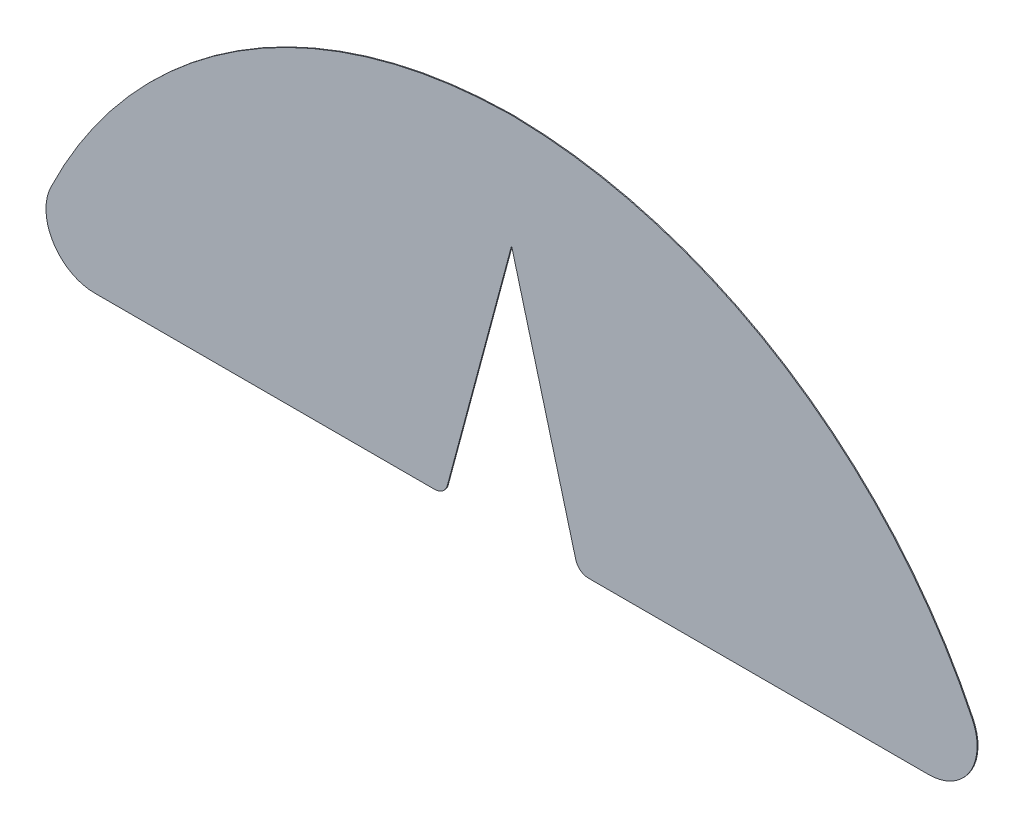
ISO-10303-21;
HEADER;
FILE_DESCRIPTION(('STEP AP214'),'2;1');
FILE_NAME('part.step','',(''),(''),'','','');
FILE_SCHEMA(('AUTOMOTIVE_DESIGN { 1 0 10303 214 1 1 1 1 }'));
ENDSEC;
DATA;
#1=APPLICATION_CONTEXT('core data for automotive mechanical design processes');
#2=APPLICATION_PROTOCOL_DEFINITION('international standard','automotive_design',2000,#1);
#3=PRODUCT_CONTEXT('',#1,'mechanical');
#4=PRODUCT('Part','Part','',(#3));
#5=PRODUCT_RELATED_PRODUCT_CATEGORY('part','',(#4));
#6=PRODUCT_DEFINITION_FORMATION('','',#4);
#7=PRODUCT_DEFINITION_CONTEXT('part definition',#1,'design');
#8=PRODUCT_DEFINITION('design','',#6,#7);
#9=PRODUCT_DEFINITION_SHAPE('','',#8);
#10=(LENGTH_UNIT() NAMED_UNIT(*) SI_UNIT(.MILLI.,.METRE.));
#11=(NAMED_UNIT(*) PLANE_ANGLE_UNIT() SI_UNIT($,.RADIAN.));
#12=(NAMED_UNIT(*) SI_UNIT($,.STERADIAN.) SOLID_ANGLE_UNIT());
#13=UNCERTAINTY_MEASURE_WITH_UNIT(LENGTH_MEASURE(1.E-05),#10,'distance_accuracy_value','');
#14=(GEOMETRIC_REPRESENTATION_CONTEXT(3) GLOBAL_UNCERTAINTY_ASSIGNED_CONTEXT((#13)) GLOBAL_UNIT_ASSIGNED_CONTEXT((#10,
#11,#12)) REPRESENTATION_CONTEXT('',''));
#15=CARTESIAN_POINT('',(0.,0.,0.));
#16=DIRECTION('',(0.,0.,1.));
#17=DIRECTION('',(1.,0.,0.));
#18=AXIS2_PLACEMENT_3D('',#15,#16,#17);
#19=CARTESIAN_POINT('',(0.955553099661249,-115.621051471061,0.2));
#20=DIRECTION('',(0.,0.,-1.));
#21=DIRECTION('',(-1.,0.,0.));
#22=AXIS2_PLACEMENT_3D('',#19,#20,#21);
#23=CYLINDRICAL_SURFACE('',#22,116.625);
#24=CARTESIAN_POINT('',(0.955553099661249,-115.621051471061,0.));
#25=DIRECTION('',(0.,0.,1.));
#26=DIRECTION('',(1.,0.,0.));
#27=AXIS2_PLACEMENT_3D('',#24,#25,#26);
#28=CIRCLE('',#27,116.625);
#29=CARTESIAN_POINT('',(1.,1.00394005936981,0.));
#30=VERTEX_POINT('',#29);
#31=CARTESIAN_POINT('',(0.,1.00003385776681,0.));
#32=VERTEX_POINT('',#31);
#33=EDGE_CURVE('E200',#30,#32,#28,.T.);
#34=ORIENTED_EDGE('',*,*,#33,.T.);
#35=DIRECTION('',(0.,0.,-1.));
#36=VECTOR('',#35,1.);
#37=CARTESIAN_POINT('',(0.,1.00003385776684,0.1));
#38=LINE('',#37,#36);
#39=CARTESIAN_POINT('',(0.,1.00003385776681,0.2));
#40=VERTEX_POINT('',#39);
#41=EDGE_CURVE('E155',#32,#40,#38,.F.);
#42=ORIENTED_EDGE('',*,*,#41,.T.);
#43=CARTESIAN_POINT('',(0.955553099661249,-115.621051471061,0.2));
#44=DIRECTION('',(0.,0.,1.));
#45=DIRECTION('',(1.,0.,0.));
#46=AXIS2_PLACEMENT_3D('',#43,#44,#45);
#47=CIRCLE('',#46,116.625);
#48=CARTESIAN_POINT('',(1.,1.00394005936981,0.2));
#49=VERTEX_POINT('',#48);
#50=EDGE_CURVE('E213',#49,#40,#47,.T.);
#51=ORIENTED_EDGE('',*,*,#50,.F.);
#52=DIRECTION('',(0.,0.,-1.));
#53=VECTOR('',#52,1.);
#54=CARTESIAN_POINT('',(1.,1.00394005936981,0.2));
#55=LINE('',#54,#53);
#56=EDGE_CURVE('E225',#49,#30,#55,.T.);
#57=ORIENTED_EDGE('',*,*,#56,.T.);
#58=EDGE_LOOP('',(#34,#42,#51,#57));
#59=FACE_BOUND('',#58,.T.);
#60=ADVANCED_FACE('F27',(#59),#23,.T.);
#61=CARTESIAN_POINT('',(-1.,0.987552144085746,0.2));
#62=VERTEX_POINT('',#61);
#63=CARTESIAN_POINT('',(-104.228100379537,-65.2445721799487,0.2));
#64=VERTEX_POINT('',#63);
#65=EDGE_CURVE('E212',#62,#64,#47,.T.);
#66=ORIENTED_EDGE('',*,*,#65,.F.);
#67=DIRECTION('',(0.,0.,-1.));
#68=VECTOR('',#67,1.);
#69=CARTESIAN_POINT('',(-1.,0.987552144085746,0.2));
#70=LINE('',#69,#68);
#71=CARTESIAN_POINT('',(-1.,0.987552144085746,0.));
#72=VERTEX_POINT('',#71);
#73=EDGE_CURVE('E195',#62,#72,#70,.T.);
#74=ORIENTED_EDGE('',*,*,#73,.T.);
#75=CARTESIAN_POINT('',(-104.228100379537,-65.2445721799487,0.));
#76=VERTEX_POINT('',#75);
#77=EDGE_CURVE('E137',#72,#76,#28,.T.);
#78=ORIENTED_EDGE('',*,*,#77,.T.);
#79=DIRECTION('',(0.,0.,-1.));
#80=VECTOR('',#79,1.);
#81=CARTESIAN_POINT('',(-104.228100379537,-65.2445721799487,0.2));
#82=LINE('',#81,#80);
#83=EDGE_CURVE('E11',#64,#76,#82,.T.);
#84=ORIENTED_EDGE('',*,*,#83,.F.);
#85=EDGE_LOOP('',(#66,#74,#78,#84));
#86=FACE_BOUND('',#85,.T.);
#87=ADVANCED_FACE('F29',(#86),#23,.T.);
#88=CARTESIAN_POINT('',(-94.3072413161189,-69.99605147,0.2));
#89=DIRECTION('',(0.,0.,-1.));
#90=DIRECTION('',(-1.,0.,0.));
#91=AXIS2_PLACEMENT_3D('',#88,#89,#90);
#92=CYLINDRICAL_SURFACE('',#91,11.);
#93=CARTESIAN_POINT('',(-94.3072413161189,-69.99605147,0.));
#94=DIRECTION('',(0.,0.,1.));
#95=DIRECTION('',(1.,0.,0.));
#96=AXIS2_PLACEMENT_3D('',#93,#94,#95);
#97=CIRCLE('',#96,11.);
#98=CARTESIAN_POINT('',(-94.3072413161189,-80.99605147,0.));
#99=VERTEX_POINT('',#98);
#100=EDGE_CURVE('E202',#76,#99,#97,.T.);
#101=ORIENTED_EDGE('',*,*,#100,.T.);
#102=DIRECTION('',(0.,0.,-1.));
#103=VECTOR('',#102,1.);
#104=CARTESIAN_POINT('',(-94.3072413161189,-80.99605147,0.2));
#105=LINE('',#104,#103);
#106=CARTESIAN_POINT('',(-94.3072413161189,-80.99605147,0.2));
#107=VERTEX_POINT('',#106);
#108=EDGE_CURVE('E35',#107,#99,#105,.T.);
#109=ORIENTED_EDGE('',*,*,#108,.F.);
#110=CARTESIAN_POINT('',(-94.3072413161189,-69.99605147,0.2));
#111=DIRECTION('',(0.,0.,1.));
#112=DIRECTION('',(1.,0.,0.));
#113=AXIS2_PLACEMENT_3D('',#110,#111,#112);
#114=CIRCLE('',#113,11.);
#115=EDGE_CURVE('E216',#64,#107,#114,.T.);
#116=ORIENTED_EDGE('',*,*,#115,.F.);
#117=ORIENTED_EDGE('',*,*,#83,.T.);
#118=EDGE_LOOP('',(#101,#109,#116,#117));
#119=FACE_BOUND('',#118,.T.);
#120=ADVANCED_FACE('F277',(#119),#92,.T.);
#121=CARTESIAN_POINT('',(-17.4158993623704,-80.99605147,0.2));
#122=DIRECTION('',(0.,1.,0.));
#123=DIRECTION('',(0.,0.,1.));
#124=AXIS2_PLACEMENT_3D('',#121,#122,#123);
#125=PLANE('',#124);
#126=DIRECTION('',(1.,0.,0.));
#127=VECTOR('',#126,1.);
#128=CARTESIAN_POINT('',(-17.4158993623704,-80.99605147,0.));
#129=LINE('',#128,#127);
#130=CARTESIAN_POINT('',(-17.4158993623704,-80.99605147,0.));
#131=VERTEX_POINT('',#130);
#132=EDGE_CURVE('E204',#99,#131,#129,.T.);
#133=ORIENTED_EDGE('',*,*,#132,.T.);
#134=DIRECTION('',(0.,0.,-1.));
#135=VECTOR('',#134,1.);
#136=CARTESIAN_POINT('',(-17.4158993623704,-80.99605147,0.2));
#137=LINE('',#136,#135);
#138=CARTESIAN_POINT('',(-17.4158993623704,-80.99605147,0.2));
#139=VERTEX_POINT('',#138);
#140=EDGE_CURVE('E231',#139,#131,#137,.T.);
#141=ORIENTED_EDGE('',*,*,#140,.F.);
#142=DIRECTION('',(1.,0.,0.));
#143=VECTOR('',#142,1.);
#144=CARTESIAN_POINT('',(-17.4158993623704,-80.99605147,0.2));
#145=LINE('',#144,#143);
#146=EDGE_CURVE('E218',#107,#139,#145,.T.);
#147=ORIENTED_EDGE('',*,*,#146,.F.);
#148=ORIENTED_EDGE('',*,*,#108,.T.);
#149=EDGE_LOOP('',(#133,#141,#147,#148));
#150=FACE_BOUND('',#149,.T.);
#151=ADVANCED_FACE('F238',(#150),#125,.F.);
#152=CARTESIAN_POINT('',(-17.4158993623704,-77.99605147,0.2));
#153=DIRECTION('',(0.,0.,-1.));
#154=DIRECTION('',(-1.,0.,0.));
#155=AXIS2_PLACEMENT_3D('',#152,#153,#154);
#156=CYLINDRICAL_SURFACE('',#155,3.);
#157=CARTESIAN_POINT('',(-17.4158993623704,-77.99605147,0.));
#158=DIRECTION('',(0.,0.,1.));
#159=DIRECTION('',(-1.,0.,0.));
#160=AXIS2_PLACEMENT_3D('',#157,#158,#159);
#161=CIRCLE('',#160,3.);
#162=CARTESIAN_POINT('',(-14.5181218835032,-78.7725086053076,0.));
#163=VERTEX_POINT('',#162);
#164=EDGE_CURVE('E206',#131,#163,#161,.T.);
#165=ORIENTED_EDGE('',*,*,#164,.T.);
#166=DIRECTION('',(0.,0.,-1.));
#167=VECTOR('',#166,1.);
#168=CARTESIAN_POINT('',(-14.5181218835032,-78.7725086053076,0.2));
#169=LINE('',#168,#167);
#170=CARTESIAN_POINT('',(-14.5181218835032,-78.7725086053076,0.2));
#171=VERTEX_POINT('',#170);
#172=EDGE_CURVE('E228',#171,#163,#169,.T.);
#173=ORIENTED_EDGE('',*,*,#172,.F.);
#174=CARTESIAN_POINT('',(-17.4158993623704,-77.99605147,0.2));
#175=DIRECTION('',(0.,0.,1.));
#176=DIRECTION('',(-1.,0.,0.));
#177=AXIS2_PLACEMENT_3D('',#174,#175,#176);
#178=CIRCLE('',#177,3.);
#179=EDGE_CURVE('E220',#139,#171,#178,.T.);
#180=ORIENTED_EDGE('',*,*,#179,.F.);
#181=ORIENTED_EDGE('',*,*,#140,.T.);
#182=EDGE_LOOP('',(#165,#173,#180,#181));
#183=FACE_BOUND('',#182,.T.);
#184=ADVANCED_FACE('F246',(#183),#156,.T.);
#185=CARTESIAN_POINT('',(1.,-20.8580892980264,0.2));
#186=DIRECTION('',(-0.965925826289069,0.258819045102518,0.));
#187=DIRECTION('',(-0.258819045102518,-0.965925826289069,0.));
#188=AXIS2_PLACEMENT_3D('',#185,#186,#187);
#189=PLANE('',#188);
#190=DIRECTION('',(0.258819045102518,0.965925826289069,0.));
#191=VECTOR('',#190,1.);
#192=CARTESIAN_POINT('',(1.,-20.8580892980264,0.));
#193=LINE('',#192,#191);
#194=CARTESIAN_POINT('',(0.,-24.5901401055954,0.));
#195=VERTEX_POINT('',#194);
#196=EDGE_CURVE('E208',#163,#195,#193,.T.);
#197=ORIENTED_EDGE('',*,*,#196,.T.);
#198=DIRECTION('',(0.,0.,1.));
#199=VECTOR('',#198,1.);
#200=CARTESIAN_POINT('',(0.,-24.5901401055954,0.2));
#201=LINE('',#200,#199);
#202=CARTESIAN_POINT('',(0.,-24.5901401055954,0.2));
#203=VERTEX_POINT('',#202);
#204=EDGE_CURVE('E50',#195,#203,#201,.T.);
#205=ORIENTED_EDGE('',*,*,#204,.T.);
#206=DIRECTION('',(0.258819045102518,0.965925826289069,0.));
#207=VECTOR('',#206,1.);
#208=CARTESIAN_POINT('',(1.,-20.8580892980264,0.2));
#209=LINE('',#208,#207);
#210=EDGE_CURVE('E222',#171,#203,#209,.T.);
#211=ORIENTED_EDGE('',*,*,#210,.F.);
#212=ORIENTED_EDGE('',*,*,#172,.T.);
#213=EDGE_LOOP('',(#197,#205,#211,#212));
#214=FACE_BOUND('',#213,.T.);
#215=ADVANCED_FACE('F248',(#214),#189,.F.);
#216=CARTESIAN_POINT('',(1.,1.00394005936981,0.2));
#217=DIRECTION('',(-1.,0.,0.));
#218=DIRECTION('',(0.,0.,1.));
#219=AXIS2_PLACEMENT_3D('',#216,#217,#218);
#220=PLANE('',#219);
#221=DIRECTION('',(0.,1.,0.));
#222=VECTOR('',#221,1.);
#223=CARTESIAN_POINT('',(1.,1.00394005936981,0.2));
#224=LINE('',#223,#222);
#225=CARTESIAN_POINT('',(1.,0.987552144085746,0.2));
#226=VERTEX_POINT('',#225);
#227=EDGE_CURVE('E42',#226,#49,#224,.T.);
#228=ORIENTED_EDGE('',*,*,#227,.F.);
#229=DIRECTION('',(0.,0.,-1.));
#230=VECTOR('',#229,1.);
#231=CARTESIAN_POINT('',(1.,0.987552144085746,0.2));
#232=LINE('',#231,#230);
#233=CARTESIAN_POINT('',(1.,0.987552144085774,0.));
#234=VERTEX_POINT('',#233);
#235=EDGE_CURVE('E197',#226,#234,#232,.T.);
#236=ORIENTED_EDGE('',*,*,#235,.T.);
#237=DIRECTION('',(0.,1.,0.));
#238=VECTOR('',#237,1.);
#239=CARTESIAN_POINT('',(1.,1.00394005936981,0.));
#240=LINE('',#239,#238);
#241=EDGE_CURVE('E210',#234,#30,#240,.T.);
#242=ORIENTED_EDGE('',*,*,#241,.T.);
#243=ORIENTED_EDGE('',*,*,#56,.F.);
#244=EDGE_LOOP('',(#228,#236,#242,#243));
#245=FACE_BOUND('',#244,.T.);
#246=ADVANCED_FACE('F272',(#245),#220,.F.);
#247=CARTESIAN_POINT('',(0.955553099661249,-115.621051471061,0.2));
#248=DIRECTION('',(0.,0.,1.));
#249=DIRECTION('',(1.,0.,0.));
#250=AXIS2_PLACEMENT_3D('',#247,#248,#249);
#251=PLANE('',#250);
#252=ORIENTED_EDGE('',*,*,#50,.T.);
#253=CARTESIAN_POINT('',(-0.955553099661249,-115.621051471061,0.2));
#254=DIRECTION('',(0.,0.,-1.));
#255=DIRECTION('',(-1.,0.,0.));
#256=AXIS2_PLACEMENT_3D('',#253,#254,#255);
#257=CIRCLE('',#256,116.625);
#258=CARTESIAN_POINT('',(-1.,1.00394005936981,0.2));
#259=VERTEX_POINT('',#258);
#260=EDGE_CURVE('E171',#259,#40,#257,.T.);
#261=ORIENTED_EDGE('',*,*,#260,.F.);
#262=DIRECTION('',(0.,1.,0.));
#263=VECTOR('',#262,1.);
#264=CARTESIAN_POINT('',(-1.,1.00394005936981,0.2));
#265=LINE('',#264,#263);
#266=EDGE_CURVE('E147',#62,#259,#265,.T.);
#267=ORIENTED_EDGE('',*,*,#266,.F.);
#268=ORIENTED_EDGE('',*,*,#65,.T.);
#269=ORIENTED_EDGE('',*,*,#115,.T.);
#270=ORIENTED_EDGE('',*,*,#146,.T.);
#271=ORIENTED_EDGE('',*,*,#179,.T.);
#272=ORIENTED_EDGE('',*,*,#210,.T.);
#273=DIRECTION('',(-0.258819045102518,0.965925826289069,0.));
#274=VECTOR('',#273,1.);
#275=CARTESIAN_POINT('',(-1.,-20.8580892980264,0.2));
#276=LINE('',#275,#274);
#277=CARTESIAN_POINT('',(14.5181218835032,-78.7725086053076,0.2));
#278=VERTEX_POINT('',#277);
#279=EDGE_CURVE('E174',#278,#203,#276,.T.);
#280=ORIENTED_EDGE('',*,*,#279,.F.);
#281=CARTESIAN_POINT('',(17.4158993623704,-77.99605147,0.2));
#282=DIRECTION('',(0.,0.,-1.));
#283=DIRECTION('',(1.,0.,0.));
#284=AXIS2_PLACEMENT_3D('',#281,#282,#283);
#285=CIRCLE('',#284,3.);
#286=CARTESIAN_POINT('',(17.4158993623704,-80.99605147,0.2));
#287=VERTEX_POINT('',#286);
#288=EDGE_CURVE('E177',#287,#278,#285,.T.);
#289=ORIENTED_EDGE('',*,*,#288,.F.);
#290=DIRECTION('',(-1.,0.,0.));
#291=VECTOR('',#290,1.);
#292=CARTESIAN_POINT('',(17.4158993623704,-80.99605147,0.2));
#293=LINE('',#292,#291);
#294=CARTESIAN_POINT('',(94.3072413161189,-80.99605147,0.2));
#295=VERTEX_POINT('',#294);
#296=EDGE_CURVE('E180',#295,#287,#293,.T.);
#297=ORIENTED_EDGE('',*,*,#296,.F.);
#298=CARTESIAN_POINT('',(94.3072413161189,-69.99605147,0.2));
#299=DIRECTION('',(0.,0.,-1.));
#300=DIRECTION('',(-1.,0.,0.));
#301=AXIS2_PLACEMENT_3D('',#298,#299,#300);
#302=CIRCLE('',#301,11.);
#303=CARTESIAN_POINT('',(104.228100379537,-65.2445721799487,0.2));
#304=VERTEX_POINT('',#303);
#305=EDGE_CURVE('E183',#304,#295,#302,.T.);
#306=ORIENTED_EDGE('',*,*,#305,.F.);
#307=EDGE_CURVE('E170',#226,#304,#257,.T.);
#308=ORIENTED_EDGE('',*,*,#307,.F.);
#309=ORIENTED_EDGE('',*,*,#227,.T.);
#310=EDGE_LOOP('',(#252,#261,#267,#268,#269,#270,#271,#272,#280,#289,#297,#306,#308,#309));
#311=FACE_BOUND('',#310,.T.);
#312=ADVANCED_FACE('F251',(#311),#251,.T.);
#313=CARTESIAN_POINT('',(0.955553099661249,-115.621051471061,0.));
#314=DIRECTION('',(0.,0.,1.));
#315=DIRECTION('',(1.,0.,0.));
#316=AXIS2_PLACEMENT_3D('',#313,#314,#315);
#317=PLANE('',#316);
#318=ORIENTED_EDGE('',*,*,#77,.F.);
#319=DIRECTION('',(0.,1.,0.));
#320=VECTOR('',#319,1.);
#321=CARTESIAN_POINT('',(-1.,1.00394005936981,0.));
#322=LINE('',#321,#320);
#323=CARTESIAN_POINT('',(-1.,1.00394005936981,0.));
#324=VERTEX_POINT('',#323);
#325=EDGE_CURVE('E130',#72,#324,#322,.T.);
#326=ORIENTED_EDGE('',*,*,#325,.T.);
#327=CARTESIAN_POINT('',(-0.955553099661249,-115.621051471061,0.));
#328=DIRECTION('',(0.,0.,-1.));
#329=DIRECTION('',(-1.,0.,0.));
#330=AXIS2_PLACEMENT_3D('',#327,#328,#329);
#331=CIRCLE('',#330,116.625);
#332=EDGE_CURVE('E135',#324,#32,#331,.T.);
#333=ORIENTED_EDGE('',*,*,#332,.T.);
#334=ORIENTED_EDGE('',*,*,#33,.F.);
#335=ORIENTED_EDGE('',*,*,#241,.F.);
#336=CARTESIAN_POINT('',(104.228100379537,-65.2445721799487,0.));
#337=VERTEX_POINT('',#336);
#338=EDGE_CURVE('E156',#234,#337,#331,.T.);
#339=ORIENTED_EDGE('',*,*,#338,.T.);
#340=CARTESIAN_POINT('',(94.3072413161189,-69.99605147,0.));
#341=DIRECTION('',(0.,0.,-1.));
#342=DIRECTION('',(-1.,0.,0.));
#343=AXIS2_PLACEMENT_3D('',#340,#341,#342);
#344=CIRCLE('',#343,11.);
#345=CARTESIAN_POINT('',(94.3072413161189,-80.99605147,0.));
#346=VERTEX_POINT('',#345);
#347=EDGE_CURVE('E167',#337,#346,#344,.T.);
#348=ORIENTED_EDGE('',*,*,#347,.T.);
#349=DIRECTION('',(-1.,0.,0.));
#350=VECTOR('',#349,1.);
#351=CARTESIAN_POINT('',(17.4158993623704,-80.99605147,0.));
#352=LINE('',#351,#350);
#353=CARTESIAN_POINT('',(17.4158993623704,-80.99605147,0.));
#354=VERTEX_POINT('',#353);
#355=EDGE_CURVE('E164',#346,#354,#352,.T.);
#356=ORIENTED_EDGE('',*,*,#355,.T.);
#357=CARTESIAN_POINT('',(17.4158993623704,-77.99605147,0.));
#358=DIRECTION('',(0.,0.,-1.));
#359=DIRECTION('',(1.,0.,0.));
#360=AXIS2_PLACEMENT_3D('',#357,#358,#359);
#361=CIRCLE('',#360,3.);
#362=CARTESIAN_POINT('',(14.5181218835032,-78.7725086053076,0.));
#363=VERTEX_POINT('',#362);
#364=EDGE_CURVE('E161',#354,#363,#361,.T.);
#365=ORIENTED_EDGE('',*,*,#364,.T.);
#366=DIRECTION('',(-0.258819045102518,0.965925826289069,0.));
#367=VECTOR('',#366,1.);
#368=CARTESIAN_POINT('',(-1.,-20.8580892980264,0.));
#369=LINE('',#368,#367);
#370=EDGE_CURVE('E141',#363,#195,#369,.T.);
#371=ORIENTED_EDGE('',*,*,#370,.T.);
#372=ORIENTED_EDGE('',*,*,#196,.F.);
#373=ORIENTED_EDGE('',*,*,#164,.F.);
#374=ORIENTED_EDGE('',*,*,#132,.F.);
#375=ORIENTED_EDGE('',*,*,#100,.F.);
#376=EDGE_LOOP('',(#318,#326,#333,#334,#335,#339,#348,#356,#365,#371,#372,#373,#374,#375));
#377=FACE_BOUND('',#376,.T.);
#378=ADVANCED_FACE('F132',(#377),#317,.F.);
#379=CARTESIAN_POINT('',(94.3072413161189,-69.99605147,0.2));
#380=DIRECTION('',(0.,0.,-1.));
#381=DIRECTION('',(-1.,0.,0.));
#382=AXIS2_PLACEMENT_3D('',#379,#380,#381);
#383=CYLINDRICAL_SURFACE('',#382,11.);
#384=ORIENTED_EDGE('',*,*,#347,.F.);
#385=DIRECTION('',(0.,0.,-1.));
#386=VECTOR('',#385,1.);
#387=CARTESIAN_POINT('',(104.228100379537,-65.2445721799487,0.2));
#388=LINE('',#387,#386);
#389=EDGE_CURVE('E186',#304,#337,#388,.T.);
#390=ORIENTED_EDGE('',*,*,#389,.F.);
#391=ORIENTED_EDGE('',*,*,#305,.T.);
#392=DIRECTION('',(0.,0.,-1.));
#393=VECTOR('',#392,1.);
#394=CARTESIAN_POINT('',(94.3072413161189,-80.99605147,0.2));
#395=LINE('',#394,#393);
#396=EDGE_CURVE('E189',#295,#346,#395,.T.);
#397=ORIENTED_EDGE('',*,*,#396,.T.);
#398=EDGE_LOOP('',(#384,#390,#391,#397));
#399=FACE_BOUND('',#398,.T.);
#400=ADVANCED_FACE('F266',(#399),#383,.T.);
#401=CARTESIAN_POINT('',(17.4158993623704,-80.99605147,0.2));
#402=DIRECTION('',(0.,-1.,0.));
#403=DIRECTION('',(0.,0.,-1.));
#404=AXIS2_PLACEMENT_3D('',#401,#402,#403);
#405=PLANE('',#404);
#406=ORIENTED_EDGE('',*,*,#355,.F.);
#407=ORIENTED_EDGE('',*,*,#396,.F.);
#408=ORIENTED_EDGE('',*,*,#296,.T.);
#409=DIRECTION('',(0.,0.,-1.));
#410=VECTOR('',#409,1.);
#411=CARTESIAN_POINT('',(17.4158993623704,-80.99605147,0.2));
#412=LINE('',#411,#410);
#413=EDGE_CURVE('E191',#287,#354,#412,.T.);
#414=ORIENTED_EDGE('',*,*,#413,.T.);
#415=EDGE_LOOP('',(#406,#407,#408,#414));
#416=FACE_BOUND('',#415,.T.);
#417=ADVANCED_FACE('F263',(#416),#405,.T.);
#418=CARTESIAN_POINT('',(17.4158993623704,-77.99605147,0.2));
#419=DIRECTION('',(0.,0.,-1.));
#420=DIRECTION('',(-1.,0.,0.));
#421=AXIS2_PLACEMENT_3D('',#418,#419,#420);
#422=CYLINDRICAL_SURFACE('',#421,3.);
#423=ORIENTED_EDGE('',*,*,#364,.F.);
#424=ORIENTED_EDGE('',*,*,#413,.F.);
#425=ORIENTED_EDGE('',*,*,#288,.T.);
#426=DIRECTION('',(0.,0.,-1.));
#427=VECTOR('',#426,1.);
#428=CARTESIAN_POINT('',(14.5181218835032,-78.7725086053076,0.2));
#429=LINE('',#428,#427);
#430=EDGE_CURVE('E151',#278,#363,#429,.T.);
#431=ORIENTED_EDGE('',*,*,#430,.T.);
#432=EDGE_LOOP('',(#423,#424,#425,#431));
#433=FACE_BOUND('',#432,.T.);
#434=ADVANCED_FACE('F258',(#433),#422,.T.);
#435=CARTESIAN_POINT('',(-1.,-20.8580892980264,0.2));
#436=DIRECTION('',(-0.965925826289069,-0.258819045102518,0.));
#437=DIRECTION('',(0.258819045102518,-0.965925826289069,0.));
#438=AXIS2_PLACEMENT_3D('',#435,#436,#437);
#439=PLANE('',#438);
#440=ORIENTED_EDGE('',*,*,#204,.F.);
#441=ORIENTED_EDGE('',*,*,#370,.F.);
#442=ORIENTED_EDGE('',*,*,#430,.F.);
#443=ORIENTED_EDGE('',*,*,#279,.T.);
#444=EDGE_LOOP('',(#440,#441,#442,#443));
#445=FACE_BOUND('',#444,.T.);
#446=ADVANCED_FACE('F254',(#445),#439,.T.);
#447=CARTESIAN_POINT('',(-0.955553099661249,-115.621051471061,0.2));
#448=DIRECTION('',(0.,0.,-1.));
#449=DIRECTION('',(-1.,0.,0.));
#450=AXIS2_PLACEMENT_3D('',#447,#448,#449);
#451=CYLINDRICAL_SURFACE('',#450,116.625);
#452=ORIENTED_EDGE('',*,*,#235,.F.);
#453=ORIENTED_EDGE('',*,*,#307,.T.);
#454=ORIENTED_EDGE('',*,*,#389,.T.);
#455=ORIENTED_EDGE('',*,*,#338,.F.);
#456=EDGE_LOOP('',(#452,#453,#454,#455));
#457=FACE_BOUND('',#456,.T.);
#458=ADVANCED_FACE('F270',(#457),#451,.T.);
#459=ORIENTED_EDGE('',*,*,#41,.F.);
#460=ORIENTED_EDGE('',*,*,#332,.F.);
#461=DIRECTION('',(0.,0.,-1.));
#462=VECTOR('',#461,1.);
#463=CARTESIAN_POINT('',(-1.,1.00394005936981,0.2));
#464=LINE('',#463,#462);
#465=EDGE_CURVE('E144',#259,#324,#464,.T.);
#466=ORIENTED_EDGE('',*,*,#465,.F.);
#467=ORIENTED_EDGE('',*,*,#260,.T.);
#468=EDGE_LOOP('',(#459,#460,#466,#467));
#469=FACE_BOUND('',#468,.T.);
#470=ADVANCED_FACE('F154',(#469),#451,.T.);
#471=CARTESIAN_POINT('',(-1.,1.00394005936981,0.2));
#472=DIRECTION('',(-1.,0.,0.));
#473=DIRECTION('',(0.,0.,1.));
#474=AXIS2_PLACEMENT_3D('',#471,#472,#473);
#475=PLANE('',#474);
#476=ORIENTED_EDGE('',*,*,#73,.F.);
#477=ORIENTED_EDGE('',*,*,#266,.T.);
#478=ORIENTED_EDGE('',*,*,#465,.T.);
#479=ORIENTED_EDGE('',*,*,#325,.F.);
#480=EDGE_LOOP('',(#476,#477,#478,#479));
#481=FACE_BOUND('',#480,.T.);
#482=ADVANCED_FACE('F145',(#481),#475,.T.);
#483=CLOSED_SHELL('',(#60,#87,#120,#151,#184,#215,#246,#312,#378,#400,#417,#434,#446,#458,#470,#482));
#484=MANIFOLD_SOLID_BREP('B2',#483);
#485=ADVANCED_BREP_SHAPE_REPRESENTATION('',(#18,#484),#14);
#486=SHAPE_DEFINITION_REPRESENTATION(#9,#485);
ENDSEC;
END-ISO-10303-21;
